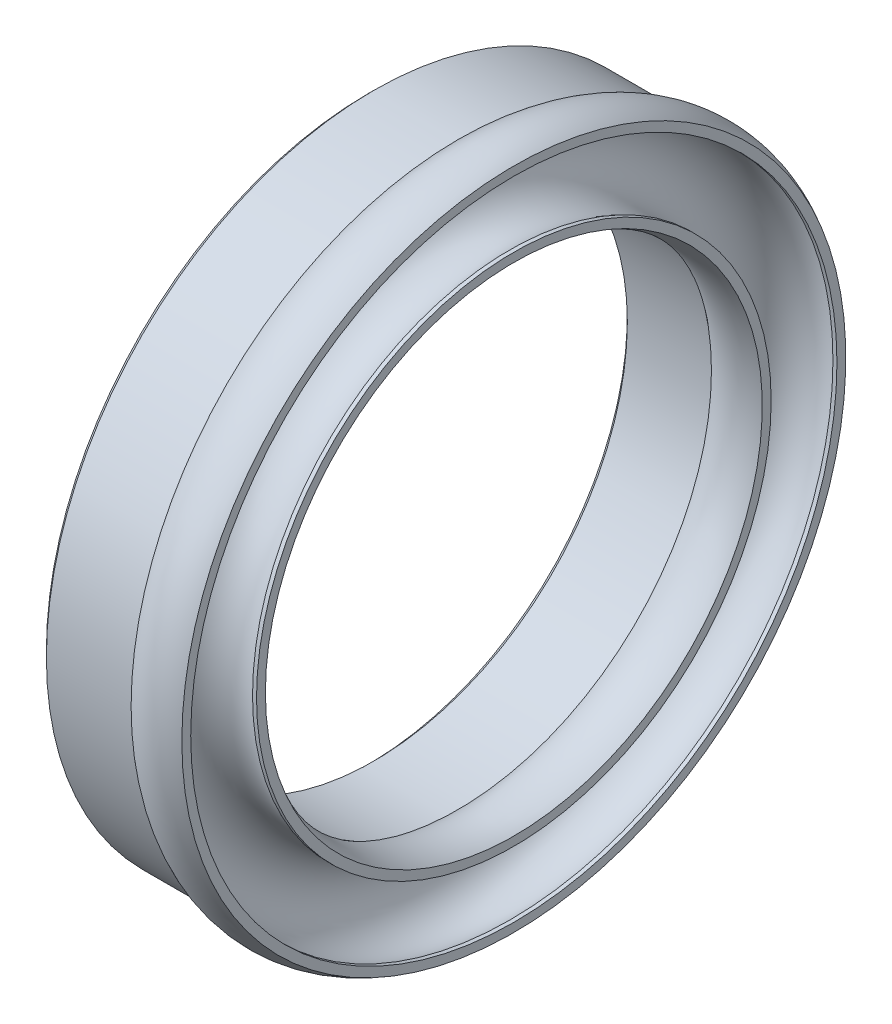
ISO-10303-21;
HEADER;
FILE_DESCRIPTION(('STEP AP214'),'2;1');
FILE_NAME('part.step','',(''),(''),'','','');
FILE_SCHEMA(('AUTOMOTIVE_DESIGN { 1 0 10303 214 1 1 1 1 }'));
ENDSEC;
DATA;
#1=APPLICATION_CONTEXT('core data for automotive mechanical design processes');
#2=APPLICATION_PROTOCOL_DEFINITION('international standard','automotive_design',2000,#1);
#3=PRODUCT_CONTEXT('',#1,'mechanical');
#4=PRODUCT('Part','Part','',(#3));
#5=PRODUCT_RELATED_PRODUCT_CATEGORY('part','',(#4));
#6=PRODUCT_DEFINITION_FORMATION('','',#4);
#7=PRODUCT_DEFINITION_CONTEXT('part definition',#1,'design');
#8=PRODUCT_DEFINITION('design','',#6,#7);
#9=PRODUCT_DEFINITION_SHAPE('','',#8);
#10=(LENGTH_UNIT() NAMED_UNIT(*) SI_UNIT(.MILLI.,.METRE.));
#11=(NAMED_UNIT(*) PLANE_ANGLE_UNIT() SI_UNIT($,.RADIAN.));
#12=(NAMED_UNIT(*) SI_UNIT($,.STERADIAN.) SOLID_ANGLE_UNIT());
#13=UNCERTAINTY_MEASURE_WITH_UNIT(LENGTH_MEASURE(1.E-05),#10,'distance_accuracy_value','');
#14=(GEOMETRIC_REPRESENTATION_CONTEXT(3) GLOBAL_UNCERTAINTY_ASSIGNED_CONTEXT((#13)) GLOBAL_UNIT_ASSIGNED_CONTEXT((#10,
#11,#12)) REPRESENTATION_CONTEXT('',''));
#15=CARTESIAN_POINT('',(0.,0.,0.));
#16=DIRECTION('',(0.,0.,1.));
#17=DIRECTION('',(1.,0.,0.));
#18=AXIS2_PLACEMENT_3D('',#15,#16,#17);
#19=CARTESIAN_POINT('',(3.97500112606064,1.66533453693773E-13,0.));
#20=DIRECTION('',(-1.,0.,0.));
#21=DIRECTION('',(0.,0.,0.999999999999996));
#22=AXIS2_PLACEMENT_3D('',#19,#20,#21);
#23=TOROIDAL_SURFACE('',#22,9.525,1.5875);
#24=CARTESIAN_POINT('',(4.77520000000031,0.,0.));
#25=DIRECTION('',(-1.,0.,0.));
#26=DIRECTION('',(0.,0.,0.999999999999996));
#27=AXIS2_PLACEMENT_3D('',#24,#25,#26);
#28=CIRCLE('',#27,8.15392815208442);
#29=CARTESIAN_POINT('',(4.77520000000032,-1.15421654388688E-13,8.15392815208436));
#30=VERTEX_POINT('',#29);
#31=EDGE_CURVE('E10',#30,#30,#28,.T.);
#32=ORIENTED_EDGE('',*,*,#31,.F.);
#33=EDGE_LOOP('',(#32));
#34=FACE_BOUND('',#33,.T.);
#35=CARTESIAN_POINT('',(2.93812119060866,0.,0.));
#36=DIRECTION('',(-1.,0.,0.));
#37=DIRECTION('',(0.,0.,0.999999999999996));
#38=AXIS2_PLACEMENT_3D('',#35,#36,#37);
#39=CIRCLE('',#38,8.3229033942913);
#40=CARTESIAN_POINT('',(2.93812119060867,-1.7332470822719E-13,8.32290339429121));
#41=VERTEX_POINT('',#40);
#42=EDGE_CURVE('E70',#41,#41,#39,.T.);
#43=ORIENTED_EDGE('',*,*,#42,.T.);
#44=EDGE_LOOP('',(#43));
#45=FACE_BOUND('',#44,.T.);
#46=ADVANCED_FACE('F30',(#34,#45),#23,.T.);
#47=CARTESIAN_POINT('',(4.77519999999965,8.15392815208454,-2.22044604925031E-13));
#48=DIRECTION('',(-1.,0.,0.));
#49=DIRECTION('',(0.,0.,0.999999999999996));
#50=AXIS2_PLACEMENT_3D('',#47,#48,#49);
#51=PLANE('',#50);
#52=CARTESIAN_POINT('',(4.77520000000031,0.,0.));
#53=DIRECTION('',(-1.,0.,0.));
#54=DIRECTION('',(0.,0.,0.999999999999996));
#55=AXIS2_PLACEMENT_3D('',#52,#53,#54);
#56=CIRCLE('',#55,8.4455);
#57=CARTESIAN_POINT('',(4.77520000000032,-1.19548954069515E-13,8.44549999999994));
#58=VERTEX_POINT('',#57);
#59=EDGE_CURVE('E36',#58,#58,#56,.T.);
#60=ORIENTED_EDGE('',*,*,#59,.F.);
#61=EDGE_LOOP('',(#60));
#62=FACE_BOUND('',#61,.T.);
#63=ORIENTED_EDGE('',*,*,#31,.T.);
#64=EDGE_LOOP('',(#63));
#65=FACE_BOUND('',#64,.T.);
#66=ADVANCED_FACE('F131',(#62,#65),#51,.F.);
#67=CARTESIAN_POINT('',(-1.11022302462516E-13,0.,0.));
#68=DIRECTION('',(-1.,0.,0.));
#69=DIRECTION('',(0.,0.,0.999999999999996));
#70=AXIS2_PLACEMENT_3D('',#67,#68,#69);
#71=CYLINDRICAL_SURFACE('',#70,8.4455);
#72=CARTESIAN_POINT('',(4.64401513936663,0.,0.));
#73=DIRECTION('',(-1.,0.,0.));
#74=DIRECTION('',(0.,0.,0.999999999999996));
#75=AXIS2_PLACEMENT_3D('',#72,#73,#74);
#76=CIRCLE('',#75,8.4455);
#77=CARTESIAN_POINT('',(4.64401513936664,0.,8.44549999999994));
#78=VERTEX_POINT('',#77);
#79=EDGE_CURVE('E40',#78,#78,#76,.T.);
#80=ORIENTED_EDGE('',*,*,#79,.F.);
#81=EDGE_LOOP('',(#80));
#82=FACE_BOUND('',#81,.T.);
#83=ORIENTED_EDGE('',*,*,#59,.T.);
#84=EDGE_LOOP('',(#83));
#85=FACE_BOUND('',#84,.T.);
#86=ADVANCED_FACE('F126',(#82,#85),#71,.T.);
#87=CARTESIAN_POINT('',(3.97500112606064,1.66533453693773E-13,0.));
#88=DIRECTION('',(-1.,0.,0.));
#89=DIRECTION('',(0.,0.,0.999999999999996));
#90=AXIS2_PLACEMENT_3D('',#87,#88,#89);
#91=TOROIDAL_SURFACE('',#90,9.525,1.27);
#92=CARTESIAN_POINT('',(4.64401513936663,0.,0.));
#93=DIRECTION('',(-1.,0.,0.));
#94=DIRECTION('',(0.,0.,0.999999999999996));
#95=AXIS2_PLACEMENT_3D('',#92,#93,#94);
#96=CIRCLE('',#95,10.6045);
#97=CARTESIAN_POINT('',(4.64401513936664,0.,10.6044999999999));
#98=VERTEX_POINT('',#97);
#99=EDGE_CURVE('E44',#98,#98,#96,.T.);
#100=ORIENTED_EDGE('',*,*,#99,.F.);
#101=EDGE_LOOP('',(#100));
#102=FACE_BOUND('',#101,.T.);
#103=ORIENTED_EDGE('',*,*,#79,.T.);
#104=EDGE_LOOP('',(#103));
#105=FACE_BOUND('',#104,.T.);
#106=ADVANCED_FACE('F120',(#102,#105),#91,.F.);
#107=CARTESIAN_POINT('',(-1.11022302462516E-13,0.,0.));
#108=DIRECTION('',(-1.,0.,0.));
#109=DIRECTION('',(0.,0.,0.999999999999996));
#110=AXIS2_PLACEMENT_3D('',#107,#108,#109);
#111=CYLINDRICAL_SURFACE('',#110,10.6045);
#112=CARTESIAN_POINT('',(4.77520000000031,0.,0.));
#113=DIRECTION('',(-1.,0.,0.));
#114=DIRECTION('',(0.,0.,0.999999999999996));
#115=AXIS2_PLACEMENT_3D('',#112,#113,#114);
#116=CIRCLE('',#115,10.6045);
#117=CARTESIAN_POINT('',(4.77520000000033,-1.50110340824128E-13,10.6044999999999));
#118=VERTEX_POINT('',#117);
#119=EDGE_CURVE('E49',#118,#118,#116,.T.);
#120=ORIENTED_EDGE('',*,*,#119,.F.);
#121=EDGE_LOOP('',(#120));
#122=FACE_BOUND('',#121,.T.);
#123=ORIENTED_EDGE('',*,*,#99,.T.);
#124=EDGE_LOOP('',(#123));
#125=FACE_BOUND('',#124,.T.);
#126=ADVANCED_FACE('F114',(#122,#125),#111,.F.);
#127=CARTESIAN_POINT('',(4.77519999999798,10.6045000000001,-1.94289029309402E-13));
#128=DIRECTION('',(-1.,0.,0.));
#129=DIRECTION('',(0.,0.,0.999999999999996));
#130=AXIS2_PLACEMENT_3D('',#127,#128,#129);
#131=PLANE('',#130);
#132=CARTESIAN_POINT('',(4.77520000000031,0.,0.));
#133=DIRECTION('',(-1.,0.,0.));
#134=DIRECTION('',(0.,0.,0.999999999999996));
#135=AXIS2_PLACEMENT_3D('',#132,#133,#134);
#136=CIRCLE('',#135,10.8960718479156);
#137=CARTESIAN_POINT('',(4.77520000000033,-1.54237640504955E-13,10.8960718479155));
#138=VERTEX_POINT('',#137);
#139=EDGE_CURVE('E52',#138,#138,#136,.T.);
#140=ORIENTED_EDGE('',*,*,#139,.F.);
#141=EDGE_LOOP('',(#140));
#142=FACE_BOUND('',#141,.T.);
#143=ORIENTED_EDGE('',*,*,#119,.T.);
#144=EDGE_LOOP('',(#143));
#145=FACE_BOUND('',#144,.T.);
#146=ADVANCED_FACE('F108',(#142,#145),#131,.F.);
#147=CARTESIAN_POINT('',(3.97500112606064,1.66533453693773E-13,0.));
#148=DIRECTION('',(-1.,0.,0.));
#149=DIRECTION('',(0.,0.,0.999999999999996));
#150=AXIS2_PLACEMENT_3D('',#147,#148,#149);
#151=TOROIDAL_SURFACE('',#150,9.525,1.5875);
#152=CARTESIAN_POINT('',(2.95862634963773,0.,0.));
#153=DIRECTION('',(-1.,0.,0.));
#154=DIRECTION('',(0.,0.,0.999999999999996));
#155=AXIS2_PLACEMENT_3D('',#152,#153,#154);
#156=CIRCLE('',#155,10.7444829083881);
#157=CARTESIAN_POINT('',(2.95862634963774,-1.52091846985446E-13,10.7444829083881));
#158=VERTEX_POINT('',#157);
#159=EDGE_CURVE('E55',#158,#158,#156,.T.);
#160=ORIENTED_EDGE('',*,*,#159,.F.);
#161=EDGE_LOOP('',(#160));
#162=FACE_BOUND('',#161,.T.);
#163=ORIENTED_EDGE('',*,*,#139,.T.);
#164=EDGE_LOOP('',(#163));
#165=FACE_BOUND('',#164,.T.);
#166=ADVANCED_FACE('F102',(#162,#165),#151,.T.);
#167=CARTESIAN_POINT('',(-1.11022302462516E-13,0.,0.));
#168=DIRECTION('',(-1.,0.,0.));
#169=DIRECTION('',(0.,0.,0.999999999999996));
#170=AXIS2_PLACEMENT_3D('',#167,#168,#169);
#171=CYLINDRICAL_SURFACE('',#170,10.7444829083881);
#172=CARTESIAN_POINT('',(0.177799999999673,-1.11022302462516E-13,0.));
#173=DIRECTION('',(-1.,0.,0.));
#174=DIRECTION('',(0.,0.,0.999999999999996));
#175=AXIS2_PLACEMENT_3D('',#172,#173,#174);
#176=CIRCLE('',#175,10.7444829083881);
#177=CARTESIAN_POINT('',(0.177799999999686,-2.63114149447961E-13,10.7444829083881));
#178=VERTEX_POINT('',#177);
#179=EDGE_CURVE('E58',#178,#178,#176,.T.);
#180=ORIENTED_EDGE('',*,*,#179,.F.);
#181=EDGE_LOOP('',(#180));
#182=FACE_BOUND('',#181,.T.);
#183=ORIENTED_EDGE('',*,*,#159,.T.);
#184=EDGE_LOOP('',(#183));
#185=FACE_BOUND('',#184,.T.);
#186=ADVANCED_FACE('F96',(#182,#185),#171,.T.);
#187=CARTESIAN_POINT('',(0.177799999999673,-1.11022302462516E-13,0.));
#188=DIRECTION('',(1.,0.,0.));
#189=DIRECTION('',(0.,0.,-0.999999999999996));
#190=AXIS2_PLACEMENT_3D('',#187,#188,#189);
#191=CONICAL_SURFACE('',#190,10.7444829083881,0.785398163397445);
#192=CARTESIAN_POINT('',(-1.11022302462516E-13,0.,0.));
#193=DIRECTION('',(-1.,0.,0.));
#194=DIRECTION('',(0.,0.,0.999999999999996));
#195=AXIS2_PLACEMENT_3D('',#192,#193,#194);
#196=CIRCLE('',#195,10.5666829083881);
#197=CARTESIAN_POINT('',(0.,-1.49575026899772E-13,10.5666829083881));
#198=VERTEX_POINT('',#197);
#199=EDGE_CURVE('E61',#198,#198,#196,.T.);
#200=ORIENTED_EDGE('',*,*,#199,.F.);
#201=EDGE_LOOP('',(#200));
#202=FACE_BOUND('',#201,.T.);
#203=ORIENTED_EDGE('',*,*,#179,.T.);
#204=EDGE_LOOP('',(#203));
#205=FACE_BOUND('',#204,.T.);
#206=ADVANCED_FACE('F90',(#202,#205),#191,.T.);
#207=CARTESIAN_POINT('',(-7.7715611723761E-13,8.50070339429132,-1.94289029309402E-13));
#208=DIRECTION('',(1.,0.,0.));
#209=DIRECTION('',(0.,0.,-0.999999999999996));
#210=AXIS2_PLACEMENT_3D('',#207,#208,#209);
#211=PLANE('',#210);
#212=CARTESIAN_POINT('',(-1.11022302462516E-13,0.,0.));
#213=DIRECTION('',(-1.,0.,0.));
#214=DIRECTION('',(0.,0.,0.999999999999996));
#215=AXIS2_PLACEMENT_3D('',#212,#213,#214);
#216=CIRCLE('',#215,8.5007033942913);
#217=CARTESIAN_POINT('',(-1.00109988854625E-13,-1.20330377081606E-13,8.50070339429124));
#218=VERTEX_POINT('',#217);
#219=EDGE_CURVE('E64',#218,#218,#216,.T.);
#220=ORIENTED_EDGE('',*,*,#219,.F.);
#221=EDGE_LOOP('',(#220));
#222=FACE_BOUND('',#221,.T.);
#223=ORIENTED_EDGE('',*,*,#199,.T.);
#224=EDGE_LOOP('',(#223));
#225=FACE_BOUND('',#224,.T.);
#226=ADVANCED_FACE('F84',(#222,#225),#211,.F.);
#227=CARTESIAN_POINT('',(-1.11022302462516E-13,0.,0.));
#228=DIRECTION('',(-1.,0.,0.));
#229=DIRECTION('',(0.,0.,0.999999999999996));
#230=AXIS2_PLACEMENT_3D('',#227,#228,#229);
#231=CONICAL_SURFACE('',#230,8.5007033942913,0.785398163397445);
#232=CARTESIAN_POINT('',(0.177799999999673,-1.11022302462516E-13,0.));
#233=DIRECTION('',(-1.,0.,0.));
#234=DIRECTION('',(0.,0.,0.999999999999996));
#235=AXIS2_PLACEMENT_3D('',#232,#233,#234);
#236=CIRCLE('',#235,8.3229033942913);
#237=CARTESIAN_POINT('',(0.177799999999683,-2.28835859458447E-13,8.32290339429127));
#238=VERTEX_POINT('',#237);
#239=EDGE_CURVE('E67',#238,#238,#236,.T.);
#240=ORIENTED_EDGE('',*,*,#239,.F.);
#241=EDGE_LOOP('',(#240));
#242=FACE_BOUND('',#241,.T.);
#243=ORIENTED_EDGE('',*,*,#219,.T.);
#244=EDGE_LOOP('',(#243));
#245=FACE_BOUND('',#244,.T.);
#246=ADVANCED_FACE('F78',(#242,#245),#231,.F.);
#247=CARTESIAN_POINT('',(-1.11022302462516E-13,0.,0.));
#248=DIRECTION('',(-1.,0.,0.));
#249=DIRECTION('',(0.,0.,0.999999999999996));
#250=AXIS2_PLACEMENT_3D('',#247,#248,#249);
#251=CYLINDRICAL_SURFACE('',#250,8.3229033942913);
#252=ORIENTED_EDGE('',*,*,#42,.F.);
#253=EDGE_LOOP('',(#252));
#254=FACE_BOUND('',#253,.T.);
#255=ORIENTED_EDGE('',*,*,#239,.T.);
#256=EDGE_LOOP('',(#255));
#257=FACE_BOUND('',#256,.T.);
#258=ADVANCED_FACE('F75',(#254,#257),#251,.F.);
#259=CLOSED_SHELL('',(#46,#66,#86,#106,#126,#146,#166,#186,#206,#226,#246,#258));
#260=MANIFOLD_SOLID_BREP('B2',#259);
#261=ADVANCED_BREP_SHAPE_REPRESENTATION('',(#18,#260),#14);
#262=SHAPE_DEFINITION_REPRESENTATION(#9,#261);
ENDSEC;
END-ISO-10303-21;
